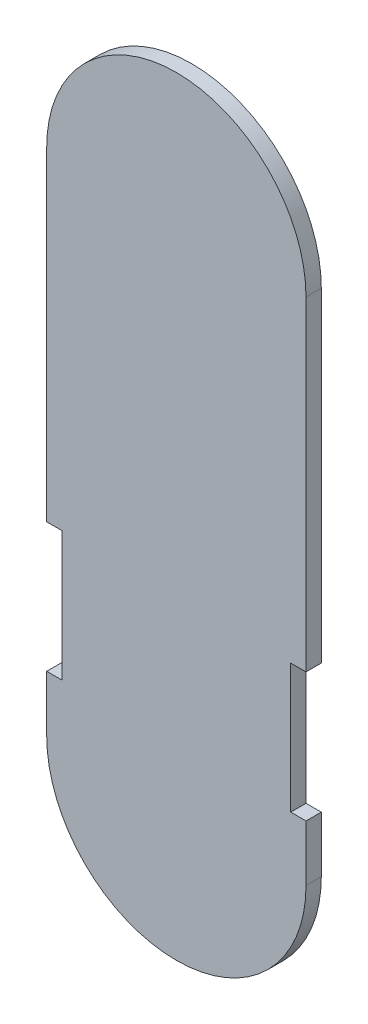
from build123d import *

# Parameters (mm, degrees)
BOSS_EXTRUDE1_DEPTH = 1.524


with BuildPart() as part:
    # Sketch1 → Boss-Extrude1 (new body)
    with BuildSketch(Plane.XY):
        with BuildLine():
            Line((0.20600674, -36.518142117), (0.20600674, -42.090079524))
            ThreePointArc((0.20600674, -42.090079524), (13.128729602, -55.012802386), (26.051452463, -42.090079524))
            Line((26.051452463, -42.090079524), (26.051452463, -36.515385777))
            Line((26.051452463, -36.515385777), (24.527452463, -36.515385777))
            Line((24.527452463, -36.515385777), (24.527452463, -23.650430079))
            Line((24.527452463, -23.650430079), (26.051452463, -23.650430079))
            Line((26.051452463, -23.650430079), (26.051452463, 8.709920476))
            ThreePointArc((26.051452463, 8.709920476), (13.128729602, 21.632643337), (0.20600674, 8.709920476))
            Line((0.20600674, 8.709920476), (0.20600674, -23.621187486))
            Line((0.20600674, -23.621187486), (1.725287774, -23.621187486))
            Line((1.725287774, -23.621187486), (1.725287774, -36.518142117))
            Line((1.725287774, -36.518142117), (0.20600674, -36.518142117))
        make_face()
    extrude(amount=BOSS_EXTRUDE1_DEPTH)


solid = part.part
